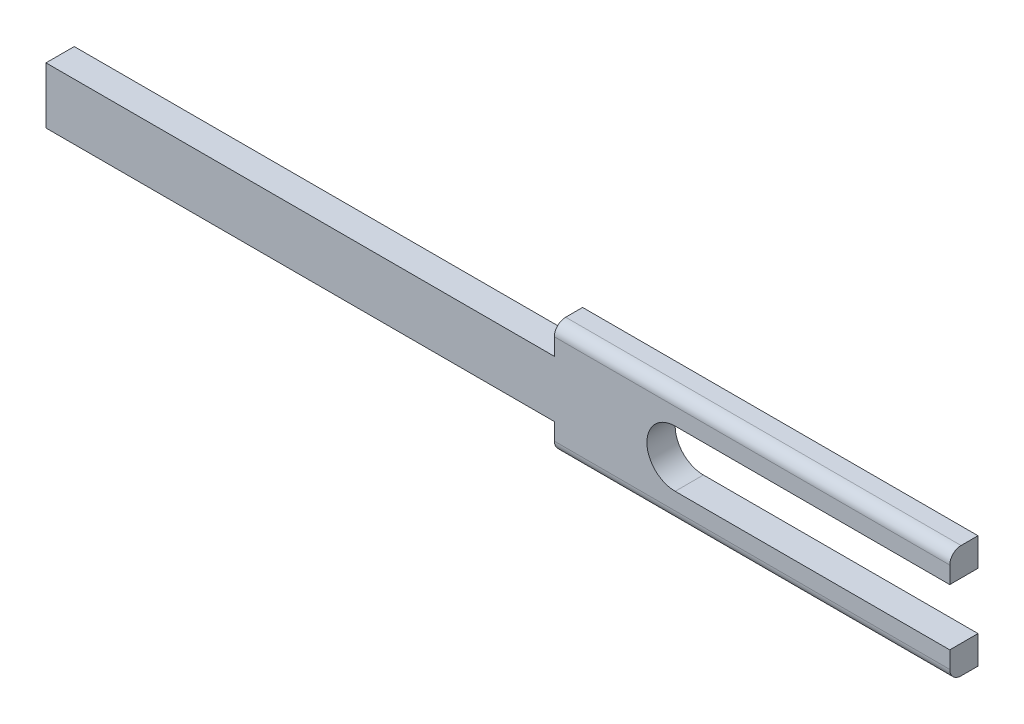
from build123d import *

# Parameters (mm, degrees)
SKETCH1_W          = 101.6
SKETCH1_H          = 25.4
EXTRUDE1_DEPTH     = 3.175
SKETCH2_OUTSIDE_W  = 124.556
SKETCH2_OUTSIDE_H  = 48.356
CUT_EXTRUDE1_DEPTH = 3.81
FILLET1_R          = 1.27
FILLET2_R          = 1.27


with BuildPart() as part:
    # Sketch1 → Extrude1 (new body)
    with BuildSketch(Plane.XY):
        with Locations((-9.275178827, -15.561587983)):
            Rectangle(SKETCH1_W, SKETCH1_H)
    extrude(amount=EXTRUDE1_DEPTH)

    # Sketch2 outside → Cut-Extrude1 (cut)
    with BuildSketch(Plane.XY.offset(3.175)):
        with Locations((-9.275, -15.562)):
            Rectangle(SKETCH2_OUTSIDE_W, SKETCH2_OUTSIDE_H)
        with BuildLine():
            Line((-2.925178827, -12.386587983), (-2.925178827, -9.211587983))
            Line((-2.925178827, -9.211587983), (43.328634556, -9.211587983))
            Line((43.328634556, -9.211587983), (43.328634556, -12.386587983))
            Line((43.328634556, -12.386587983), (10.652990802, -12.386587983))
            ThreePointArc((10.652990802, -12.386587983), (7.477990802, -15.561587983), (10.652990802, -18.736587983))
            Line((10.652990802, -18.736587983), (43.328634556, -18.736587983))
            Line((43.328634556, -18.736587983), (43.328634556, -21.911587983))
            Line((43.328634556, -21.911587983), (-2.925178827, -21.911587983))
            Line((-2.925178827, -21.911587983), (-2.925178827, -18.736587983))
            Line((-2.925178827, -18.736587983), (-60.075178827, -18.736587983))
            Line((-60.075178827, -18.736587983), (-60.075178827, -12.386587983))
            Line((-60.075178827, -12.386587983), (-2.925178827, -12.386587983))
        make_face(mode=Mode.SUBTRACT)
    extrude(amount=-CUT_EXTRUDE1_DEPTH, mode=Mode.SUBTRACT)

    # Fillet1
    fillet1_edges = [part.edges().sort_by_distance(p)[0] for p in [
        (19.299821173, -21.911587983, 3.175),
    ]]
    fillet(fillet1_edges, radius=FILLET1_R)

    # Fillet2
    fillet2_edges = [part.edges().sort_by_distance(p)[0] for p in [
        (19.299821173, -9.211587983, 3.175),
    ]]
    fillet(fillet2_edges, radius=FILLET2_R)


solid = part.part
